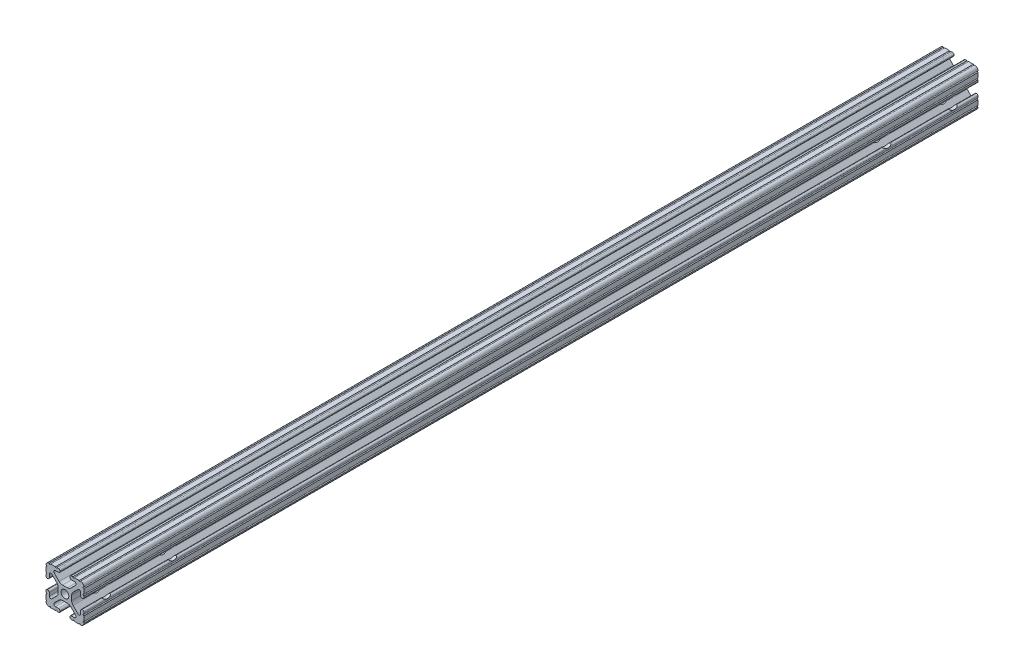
from build123d import *

# Parameters (mm, degrees)
SKETCH1_R           = 2.6035
BOSS_EXTRUDE1_DEPTH = 299.72
SKETCH3_R           = 4.1656
CUT_EXTRUDE1_DEPTH  = 302.062333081
SKETCH4_R           = 3.175
CUT_EXTRUDE2_DEPTH  = 302.062333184


with BuildPart() as part:
    # Sketch1 → Boss-Extrude1 (new, symmetric)
    with BuildSketch(Plane.XY):
        with BuildLine():
            Line((-7.179650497, -8.645192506), (-3.952270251, -5.423690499))
            ThreePointArc((-3.952270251, -5.423690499), (-2.922936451, -4.736929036), (-1.709253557, -4.4958))
            Line((-1.709253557, -4.4958), (1.709253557, -4.4958))
            ThreePointArc((1.709253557, -4.4958), (2.922936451, -4.736929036), (3.952270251, -5.423690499))
            Line((3.952270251, -5.423690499), (7.179650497, -8.645192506))
            ThreePointArc((7.179650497, -8.645192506), (7.41473083, -9.822813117), (6.416408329, -10.4902))
            Line((6.416408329, -10.4902), (4.287512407, -10.4902))
            ThreePointArc((4.287512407, -10.4902), (3.54574862, -10.79744862), (3.2385, -11.539212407))
            Line((3.2385, -11.539212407), (3.2385, -11.650987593))
            ThreePointArc((3.2385, -11.650987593), (3.54574862, -12.39275138), (4.287512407, -12.7))
            Line((4.287512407, -12.7), (5.317126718, -12.7))
            ThreePointArc((5.317126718, -12.7), (5.825126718, -12.192), (6.333126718, -12.7))
            Line((6.333126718, -12.7), (9.550443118, -12.7))
            ThreePointArc((9.550443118, -12.7), (10.058366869, -12.192000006), (10.566443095, -12.699847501))
            ThreePointArc((10.566443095, -12.699847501), (12.082537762, -12.08250727), (12.699846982, -10.566399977))
            ThreePointArc((12.699846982, -10.566399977), (12.192000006, -10.058323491), (12.7, -9.5504))
            Line((12.7, -9.5504), (12.7, -6.3330836))
            ThreePointArc((12.7, -6.3330836), (12.192, -5.8250836), (12.7, -5.3170836))
            Line((12.7, -5.3170836), (12.7, -4.287469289))
            ThreePointArc((12.7, -4.287469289), (12.39275138, -3.545705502), (11.650987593, -3.238456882))
            Line((11.650987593, -3.238456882), (11.539212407, -3.238456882))
            ThreePointArc((11.539212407, -3.238456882), (10.79744862, -3.545705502), (10.4902, -4.287469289))
            Line((10.4902, -4.287469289), (10.4902, -6.402089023))
            ThreePointArc((10.4902, -6.402089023), (9.856505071, -7.351067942), (8.737131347, -7.129408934))
            Line((8.737131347, -7.129408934), (5.441005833, -3.840816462))
            ThreePointArc((5.441005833, -3.840816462), (4.750877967, -2.809883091), (4.5085, -1.593185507))
            Line((4.5085, -1.593185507), (4.5085, 1.593185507))
            ThreePointArc((4.5085, 1.593185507), (4.750877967, 2.809883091), (5.441005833, 3.840816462))
            Line((5.441005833, 3.840816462), (8.737131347, 7.129408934))
            ThreePointArc((8.737131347, 7.129408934), (9.856505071, 7.351067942), (10.4902, 6.402089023))
            Line((10.4902, 6.402089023), (10.4902, 4.287469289))
            ThreePointArc((10.4902, 4.287469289), (10.79744862, 3.545705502), (11.539212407, 3.238456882))
            Line((11.539212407, 3.238456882), (11.650987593, 3.238456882))
            ThreePointArc((11.650987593, 3.238456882), (12.39275138, 3.545705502), (12.7, 4.287469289))
            Line((12.7, 4.287469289), (12.7, 5.3170836))
            ThreePointArc((12.7, 5.3170836), (12.192, 5.8250836), (12.7, 6.3330836))
            Line((12.7, 6.3330836), (12.7, 9.5504))
            ThreePointArc((12.7, 9.5504), (12.192000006, 10.058323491), (12.699846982, 10.566399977))
            ThreePointArc((12.699846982, 10.566399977), (12.082537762, 12.08250727), (10.566443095, 12.699847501))
            ThreePointArc((10.566443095, 12.699847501), (10.058366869, 12.192000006), (9.550443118, 12.7))
            Line((9.550443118, 12.7), (6.333126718, 12.7))
            ThreePointArc((6.333126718, 12.7), (5.825126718, 12.192), (5.317126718, 12.7))
            Line((5.317126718, 12.7), (4.287512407, 12.7))
            ThreePointArc((4.287512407, 12.7), (3.54574862, 12.39275138), (3.2385, 11.650987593))
            Line((3.2385, 11.650987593), (3.2385, 11.539212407))
            ThreePointArc((3.2385, 11.539212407), (3.54574862, 10.79744862), (4.287512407, 10.4902))
            Line((4.287512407, 10.4902), (6.476788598, 10.4902))
            ThreePointArc((6.476788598, 10.4902), (7.432222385, 9.85140422), (7.207036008, 8.724370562))
            Line((7.207036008, 8.724370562), (3.898272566, 5.423169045))
            ThreePointArc((3.898272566, 5.423169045), (2.869120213, 4.736787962), (1.655778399, 4.4958))
            Line((1.655778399, 4.4958), (-1.655778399, 4.4958))
            ThreePointArc((-1.655778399, 4.4958), (-2.869120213, 4.736787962), (-3.898272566, 5.423169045))
            Line((-3.898272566, 5.423169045), (-7.207036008, 8.724370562))
            ThreePointArc((-7.207036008, 8.724370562), (-7.432222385, 9.85140422), (-6.476788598, 10.4902))
            Line((-6.476788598, 10.4902), (-4.287512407, 10.4902))
            ThreePointArc((-4.287512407, 10.4902), (-3.54574862, 10.79744862), (-3.2385, 11.539212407))
            Line((-3.2385, 11.539212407), (-3.2385, 11.650987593))
            ThreePointArc((-3.2385, 11.650987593), (-3.54574862, 12.39275138), (-4.287512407, 12.7))
            Line((-4.287512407, 12.7), (-5.317126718, 12.7))
            ThreePointArc((-5.317126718, 12.7), (-5.825126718, 12.192), (-6.333126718, 12.7))
            Line((-6.333126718, 12.7), (-9.550443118, 12.7))
            ThreePointArc((-9.550443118, 12.7), (-10.058366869, 12.192000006), (-10.566443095, 12.699847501))
            ThreePointArc((-10.566443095, 12.699847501), (-12.082537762, 12.08250727), (-12.699846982, 10.566399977))
            ThreePointArc((-12.699846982, 10.566399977), (-12.192000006, 10.058323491), (-12.7, 9.5504))
            Line((-12.7, 9.5504), (-12.7, 6.3330836))
            ThreePointArc((-12.7, 6.3330836), (-12.192, 5.8250836), (-12.7, 5.3170836))
            Line((-12.7, 5.3170836), (-12.7, 4.287469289))
            ThreePointArc((-12.7, 4.287469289), (-12.39275138, 3.545705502), (-11.650987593, 3.238456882))
            Line((-11.650987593, 3.238456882), (-11.539212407, 3.238456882))
            ThreePointArc((-11.539212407, 3.238456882), (-10.79744862, 3.545705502), (-10.4902, 4.287469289))
            Line((-10.4902, 4.287469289), (-10.4902, 6.402089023))
            ThreePointArc((-10.4902, 6.402089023), (-9.856505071, 7.351067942), (-8.737131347, 7.129408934))
            Line((-8.737131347, 7.129408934), (-5.441005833, 3.840816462))
            ThreePointArc((-5.441005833, 3.840816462), (-4.750877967, 2.809883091), (-4.5085, 1.593185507))
            Line((-4.5085, 1.593185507), (-4.5085, -1.593185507))
            ThreePointArc((-4.5085, -1.593185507), (-4.750877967, -2.809883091), (-5.441005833, -3.840816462))
            Line((-5.441005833, -3.840816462), (-8.737131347, -7.129408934))
            ThreePointArc((-8.737131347, -7.129408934), (-9.856505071, -7.351067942), (-10.4902, -6.402089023))
            Line((-10.4902, -6.402089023), (-10.4902, -4.287469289))
            ThreePointArc((-10.4902, -4.287469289), (-10.79744862, -3.545705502), (-11.539212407, -3.238456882))
            Line((-11.539212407, -3.238456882), (-11.650987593, -3.238456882))
            ThreePointArc((-11.650987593, -3.238456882), (-12.39275138, -3.545705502), (-12.7, -4.287469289))
            Line((-12.7, -4.287469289), (-12.7, -5.3170836))
            ThreePointArc((-12.7, -5.3170836), (-12.192, -5.8250836), (-12.7, -6.3330836))
            Line((-12.7, -6.3330836), (-12.7, -9.5504))
            ThreePointArc((-12.7, -9.5504), (-12.192000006, -10.058323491), (-12.699846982, -10.566399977))
            ThreePointArc((-12.699846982, -10.566399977), (-12.082537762, -12.08250727), (-10.566443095, -12.699847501))
            ThreePointArc((-10.566443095, -12.699847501), (-10.058366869, -12.192000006), (-9.550443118, -12.7))
            Line((-9.550443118, -12.7), (-6.333126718, -12.7))
            ThreePointArc((-6.333126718, -12.7), (-5.825126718, -12.192), (-5.317126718, -12.7))
            Line((-5.317126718, -12.7), (-4.287512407, -12.7))
            ThreePointArc((-4.287512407, -12.7), (-3.54574862, -12.39275138), (-3.2385, -11.650987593))
            Line((-3.2385, -11.650987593), (-3.2385, -11.539212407))
            ThreePointArc((-3.2385, -11.539212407), (-3.54574862, -10.79744862), (-4.287512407, -10.4902))
            Line((-4.287512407, -10.4902), (-6.416408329, -10.4902))
            ThreePointArc((-6.416408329, -10.4902), (-7.41473083, -9.822813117), (-7.179650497, -8.645192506))
        make_face()
        Circle(SKETCH1_R, mode=Mode.SUBTRACT)
    extrude(amount=BOSS_EXTRUDE1_DEPTH, both=True)

    # Sketch3 → Cut-Extrude1 (cut, through all)
    with BuildSketch(Plane(origin=(12.7, 0, 0), x_dir=(0, 0, -1), z_dir=(1, 0, 0))):
        with Locations(Location((-283.845, -0.000152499, 0), (0, 0, 337.515975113))):
            Circle(SKETCH3_R)
        with Locations(Location((-239.395, -0.000152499, 0), (0, 0, 337.515975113))):
            Circle(SKETCH3_R)
        with Locations(Location((283.845000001, -0.000152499, 0), (0, 0, 337.515975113))):
            Circle(SKETCH3_R)
        with Locations(Location((239.395000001, -0.000152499, 0), (0, 0, 337.515975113))):
            Circle(SKETCH3_R)
    extrude(amount=-CUT_EXTRUDE1_DEPTH, mode=Mode.SUBTRACT)

    # Sketch4 → Cut-Extrude2 (cut, through all)
    with BuildSketch(Plane(origin=(0, 12.7, 0), x_dir=(1, 0, 0), z_dir=(0, 1, 0))):
        with Locations(Location((-0.000153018, 236.22, 0), (0, 0, 238.569977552))):
            Circle(SKETCH4_R)
        with Locations(Location((-0.000153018, -223.52, 0), (0, 0, 238.569977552))):
            Circle(SKETCH4_R)
    extrude(amount=-CUT_EXTRUDE2_DEPTH, mode=Mode.SUBTRACT)


solid = part.part
